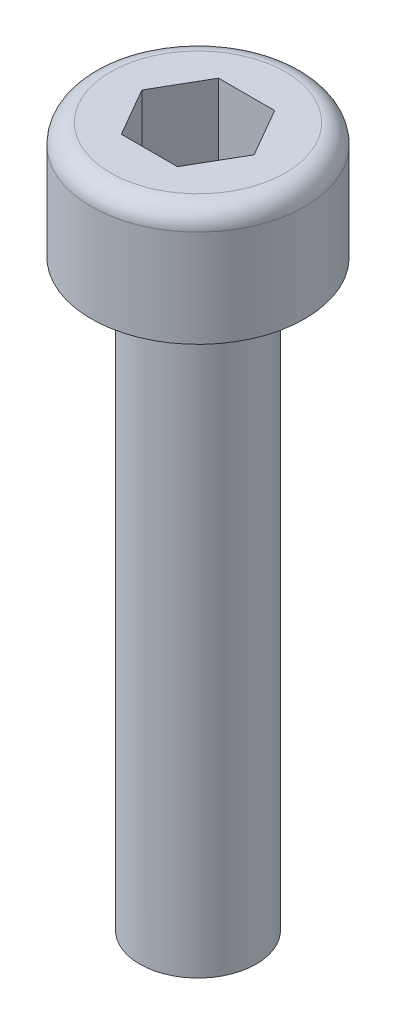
from build123d import *

# Parameters (mm, degrees)
CUT_EXTRUDE1_DEPTH = 2


with BuildPart() as part:
    # Sketch1 → Base-Revolve (revolve)
    with BuildSketch(Plane.XY):
        with BuildLine():
            Line((0, -15.401923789), (0, 3))
            Line((0, 3), (2.25, 3))
            ThreePointArc((2.25, 3), (2.603553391, 2.853553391), (2.75, 2.5))
            Line((2.75, 2.5), (2.75, 0))
            Line((2.75, 0), (1.5, 0))
            Line((1.5, 0), (1.5, -15))
            Line((1.5, -15), (0, -15.401923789))
        make_face()
    revolve(axis=Axis((0, 3, 0), (0, 1, 0)))

    # Sketch2 → Cut-Extrude1 (cut)
    with BuildSketch(Plane(origin=(0, 3, 0), x_dir=(-1, 0, 0), z_dir=(0, 1, 0))):
        Polygon((-1.443375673, 0), (-0.721687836, -1.25), (0.721687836, -1.25), (1.443375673, 0), (0.721687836, 1.25), (-0.721687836, 1.25), align=None)
    extrude(amount=-CUT_EXTRUDE1_DEPTH, mode=Mode.SUBTRACT)


solid = part.part
